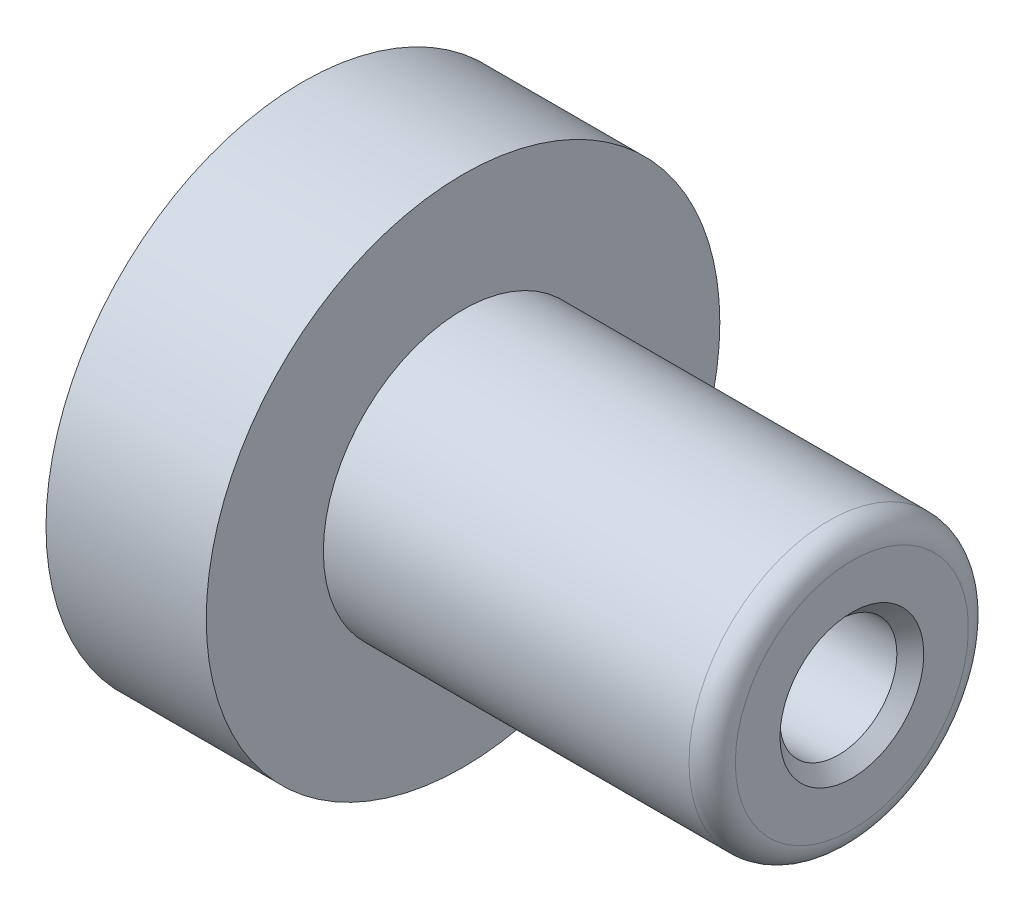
ISO-10303-21;
HEADER;
FILE_DESCRIPTION(('STEP AP214'),'2;1');
FILE_NAME('part.step','',(''),(''),'','','');
FILE_SCHEMA(('AUTOMOTIVE_DESIGN { 1 0 10303 214 1 1 1 1 }'));
ENDSEC;
DATA;
#1=APPLICATION_CONTEXT('core data for automotive mechanical design processes');
#2=APPLICATION_PROTOCOL_DEFINITION('international standard','automotive_design',2000,#1);
#3=PRODUCT_CONTEXT('',#1,'mechanical');
#4=PRODUCT('Part','Part','',(#3));
#5=PRODUCT_RELATED_PRODUCT_CATEGORY('part','',(#4));
#6=PRODUCT_DEFINITION_FORMATION('','',#4);
#7=PRODUCT_DEFINITION_CONTEXT('part definition',#1,'design');
#8=PRODUCT_DEFINITION('design','',#6,#7);
#9=PRODUCT_DEFINITION_SHAPE('','',#8);
#10=(LENGTH_UNIT() NAMED_UNIT(*) SI_UNIT(.MILLI.,.METRE.));
#11=(NAMED_UNIT(*) PLANE_ANGLE_UNIT() SI_UNIT($,.RADIAN.));
#12=(NAMED_UNIT(*) SI_UNIT($,.STERADIAN.) SOLID_ANGLE_UNIT());
#13=UNCERTAINTY_MEASURE_WITH_UNIT(LENGTH_MEASURE(1.E-05),#10,'distance_accuracy_value','');
#14=(GEOMETRIC_REPRESENTATION_CONTEXT(3) GLOBAL_UNCERTAINTY_ASSIGNED_CONTEXT((#13)) GLOBAL_UNIT_ASSIGNED_CONTEXT((#10,
#11,#12)) REPRESENTATION_CONTEXT('',''));
#15=CARTESIAN_POINT('',(0.,0.,0.));
#16=DIRECTION('',(0.,0.,1.));
#17=DIRECTION('',(1.,0.,0.));
#18=AXIS2_PLACEMENT_3D('',#15,#16,#17);
#19=CARTESIAN_POINT('',(0.,0.,0.));
#20=DIRECTION('',(-1.,0.,0.));
#21=DIRECTION('',(0.,0.,1.));
#22=AXIS2_PLACEMENT_3D('',#19,#20,#21);
#23=CYLINDRICAL_SURFACE('',#22,6.7437);
#24=CARTESIAN_POINT('',(20.447,0.,0.));
#25=DIRECTION('',(-1.,0.,0.));
#26=DIRECTION('',(0.,0.,1.));
#27=AXIS2_PLACEMENT_3D('',#24,#25,#26);
#28=CIRCLE('',#27,6.7437);
#29=CARTESIAN_POINT('',(20.447,0.,6.7437));
#30=VERTEX_POINT('',#29);
#31=EDGE_CURVE('E42',#30,#30,#28,.T.);
#32=ORIENTED_EDGE('',*,*,#31,.F.);
#33=EDGE_LOOP('',(#32));
#34=FACE_BOUND('',#33,.T.);
#35=CARTESIAN_POINT('',(0.,0.,0.));
#36=DIRECTION('',(-1.,0.,0.));
#37=DIRECTION('',(0.,0.,1.));
#38=AXIS2_PLACEMENT_3D('',#35,#36,#37);
#39=CIRCLE('',#38,6.7437);
#40=CARTESIAN_POINT('',(0.,0.,6.7437));
#41=VERTEX_POINT('',#40);
#42=EDGE_CURVE('E63',#41,#41,#39,.T.);
#43=ORIENTED_EDGE('',*,*,#42,.T.);
#44=EDGE_LOOP('',(#43));
#45=FACE_BOUND('',#44,.T.);
#46=ADVANCED_FACE('F31',(#34,#45),#23,.F.);
#47=CARTESIAN_POINT('',(20.447,6.7437,0.));
#48=DIRECTION('',(1.,0.,0.));
#49=DIRECTION('',(0.,0.,-1.));
#50=AXIS2_PLACEMENT_3D('',#47,#48,#49);
#51=PLANE('',#50);
#52=CARTESIAN_POINT('',(20.447,0.,0.));
#53=DIRECTION('',(1.,0.,0.));
#54=DIRECTION('',(0.,0.,-1.));
#55=AXIS2_PLACEMENT_3D('',#52,#53,#54);
#56=CIRCLE('',#55,3.9751);
#57=CARTESIAN_POINT('',(20.447,0.,-3.9751));
#58=VERTEX_POINT('',#57);
#59=EDGE_CURVE('E76',#58,#58,#56,.T.);
#60=ORIENTED_EDGE('',*,*,#59,.T.);
#61=EDGE_LOOP('',(#60));
#62=FACE_BOUND('',#61,.T.);
#63=ORIENTED_EDGE('',*,*,#31,.T.);
#64=EDGE_LOOP('',(#63));
#65=FACE_BOUND('',#64,.T.);
#66=ADVANCED_FACE('F82',(#62,#65),#51,.F.);
#67=CARTESIAN_POINT('',(37.338,7.9248,0.));
#68=DIRECTION('',(-1.,0.,0.));
#69=DIRECTION('',(0.,0.,1.));
#70=AXIS2_PLACEMENT_3D('',#67,#68,#69);
#71=PLANE('',#70);
#72=CARTESIAN_POINT('',(37.338,0.,0.));
#73=DIRECTION('',(-1.,0.,0.));
#74=DIRECTION('',(0.,0.,1.));
#75=AXIS2_PLACEMENT_3D('',#72,#73,#74);
#76=CIRCLE('',#75,4.88949999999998);
#77=CARTESIAN_POINT('',(37.338,0.,4.88949999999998));
#78=VERTEX_POINT('',#77);
#79=EDGE_CURVE('E10',#78,#78,#76,.T.);
#80=ORIENTED_EDGE('',*,*,#79,.T.);
#81=EDGE_LOOP('',(#80));
#82=FACE_BOUND('',#81,.T.);
#83=CARTESIAN_POINT('',(37.338,0.,0.));
#84=DIRECTION('',(-1.,0.,0.));
#85=DIRECTION('',(0.,0.,1.));
#86=AXIS2_PLACEMENT_3D('',#83,#84,#85);
#87=CIRCLE('',#86,7.9248);
#88=CARTESIAN_POINT('',(37.338,0.,7.9248));
#89=VERTEX_POINT('',#88);
#90=EDGE_CURVE('E46',#89,#89,#87,.T.);
#91=ORIENTED_EDGE('',*,*,#90,.F.);
#92=EDGE_LOOP('',(#91));
#93=FACE_BOUND('',#92,.T.);
#94=ADVANCED_FACE('F102',(#82,#93),#71,.F.);
#95=CARTESIAN_POINT('',(35.7632,0.,0.));
#96=DIRECTION('',(-1.,0.,0.));
#97=DIRECTION('',(0.,0.,1.));
#98=AXIS2_PLACEMENT_3D('',#95,#96,#97);
#99=TOROIDAL_SURFACE('',#98,7.9248,1.5748);
#100=CARTESIAN_POINT('',(35.7632,0.,0.));
#101=DIRECTION('',(-1.,0.,0.));
#102=DIRECTION('',(0.,0.,1.));
#103=AXIS2_PLACEMENT_3D('',#100,#101,#102);
#104=CIRCLE('',#103,9.4996);
#105=CARTESIAN_POINT('',(35.7632,0.,9.4996));
#106=VERTEX_POINT('',#105);
#107=EDGE_CURVE('E51',#106,#106,#104,.T.);
#108=ORIENTED_EDGE('',*,*,#107,.F.);
#109=EDGE_LOOP('',(#108));
#110=FACE_BOUND('',#109,.T.);
#111=ORIENTED_EDGE('',*,*,#90,.T.);
#112=EDGE_LOOP('',(#111));
#113=FACE_BOUND('',#112,.T.);
#114=ADVANCED_FACE('F109',(#110,#113),#99,.T.);
#115=CARTESIAN_POINT('',(0.,0.,0.));
#116=DIRECTION('',(-1.,0.,0.));
#117=DIRECTION('',(0.,0.,1.));
#118=AXIS2_PLACEMENT_3D('',#115,#116,#117);
#119=CYLINDRICAL_SURFACE('',#118,9.4996);
#120=CARTESIAN_POINT('',(10.8966,0.,0.));
#121=DIRECTION('',(-1.,0.,0.));
#122=DIRECTION('',(0.,0.,1.));
#123=AXIS2_PLACEMENT_3D('',#120,#121,#122);
#124=CIRCLE('',#123,9.4996);
#125=CARTESIAN_POINT('',(10.8966,0.,9.4996));
#126=VERTEX_POINT('',#125);
#127=EDGE_CURVE('E54',#126,#126,#124,.T.);
#128=ORIENTED_EDGE('',*,*,#127,.F.);
#129=EDGE_LOOP('',(#128));
#130=FACE_BOUND('',#129,.T.);
#131=ORIENTED_EDGE('',*,*,#107,.T.);
#132=EDGE_LOOP('',(#131));
#133=FACE_BOUND('',#132,.T.);
#134=ADVANCED_FACE('F112',(#130,#133),#119,.T.);
#135=CARTESIAN_POINT('',(10.8966,17.4625,0.));
#136=DIRECTION('',(-1.,0.,0.));
#137=DIRECTION('',(0.,0.,1.));
#138=AXIS2_PLACEMENT_3D('',#135,#136,#137);
#139=PLANE('',#138);
#140=CARTESIAN_POINT('',(10.8966,0.,0.));
#141=DIRECTION('',(-1.,0.,0.));
#142=DIRECTION('',(0.,0.,1.));
#143=AXIS2_PLACEMENT_3D('',#140,#141,#142);
#144=CIRCLE('',#143,17.4625);
#145=CARTESIAN_POINT('',(10.8966,0.,17.4625));
#146=VERTEX_POINT('',#145);
#147=EDGE_CURVE('E57',#146,#146,#144,.T.);
#148=ORIENTED_EDGE('',*,*,#147,.F.);
#149=EDGE_LOOP('',(#148));
#150=FACE_BOUND('',#149,.T.);
#151=ORIENTED_EDGE('',*,*,#127,.T.);
#152=EDGE_LOOP('',(#151));
#153=FACE_BOUND('',#152,.T.);
#154=ADVANCED_FACE('F116',(#150,#153),#139,.F.);
#155=CARTESIAN_POINT('',(0.,0.,0.));
#156=DIRECTION('',(-1.,0.,0.));
#157=DIRECTION('',(0.,0.,1.));
#158=AXIS2_PLACEMENT_3D('',#155,#156,#157);
#159=CYLINDRICAL_SURFACE('',#158,17.4625);
#160=CARTESIAN_POINT('',(0.,0.,0.));
#161=DIRECTION('',(-1.,0.,0.));
#162=DIRECTION('',(0.,0.,1.));
#163=AXIS2_PLACEMENT_3D('',#160,#161,#162);
#164=CIRCLE('',#163,17.4625);
#165=CARTESIAN_POINT('',(0.,0.,17.4625));
#166=VERTEX_POINT('',#165);
#167=EDGE_CURVE('E60',#166,#166,#164,.T.);
#168=ORIENTED_EDGE('',*,*,#167,.F.);
#169=EDGE_LOOP('',(#168));
#170=FACE_BOUND('',#169,.T.);
#171=ORIENTED_EDGE('',*,*,#147,.T.);
#172=EDGE_LOOP('',(#171));
#173=FACE_BOUND('',#172,.T.);
#174=ADVANCED_FACE('F120',(#170,#173),#159,.T.);
#175=CARTESIAN_POINT('',(0.,6.7437,0.));
#176=DIRECTION('',(1.,0.,0.));
#177=DIRECTION('',(0.,0.,-1.));
#178=AXIS2_PLACEMENT_3D('',#175,#176,#177);
#179=PLANE('',#178);
#180=CARTESIAN_POINT('',(0.,0.,11.1125));
#181=DIRECTION('',(-1.,0.,0.));
#182=DIRECTION('',(0.,0.,-1.));
#183=AXIS2_PLACEMENT_3D('',#180,#181,#182);
#184=CIRCLE('',#183,1.6129);
#185=CARTESIAN_POINT('',(0.,0.,9.4996));
#186=VERTEX_POINT('',#185);
#187=EDGE_CURVE('E73',#186,#186,#184,.T.);
#188=ORIENTED_EDGE('',*,*,#187,.F.);
#189=EDGE_LOOP('',(#188));
#190=FACE_BOUND('',#189,.T.);
#191=CARTESIAN_POINT('',(0.,0.,-11.1125));
#192=DIRECTION('',(-1.,0.,0.));
#193=DIRECTION('',(0.,0.,1.));
#194=AXIS2_PLACEMENT_3D('',#191,#192,#193);
#195=CIRCLE('',#194,1.6129);
#196=CARTESIAN_POINT('',(0.,0.,-9.4996));
#197=VERTEX_POINT('',#196);
#198=EDGE_CURVE('E67',#197,#197,#195,.T.);
#199=ORIENTED_EDGE('',*,*,#198,.F.);
#200=EDGE_LOOP('',(#199));
#201=FACE_BOUND('',#200,.T.);
#202=ORIENTED_EDGE('',*,*,#42,.F.);
#203=EDGE_LOOP('',(#202));
#204=FACE_BOUND('',#203,.T.);
#205=ORIENTED_EDGE('',*,*,#167,.T.);
#206=EDGE_LOOP('',(#205));
#207=FACE_BOUND('',#206,.T.);
#208=ADVANCED_FACE('F124',(#190,#201,#204,#207),#179,.F.);
#209=CARTESIAN_POINT('',(6.35,0.,-11.1125));
#210=DIRECTION('',(-1.,0.,0.));
#211=DIRECTION('',(0.,0.,1.));
#212=AXIS2_PLACEMENT_3D('',#209,#210,#211);
#213=CYLINDRICAL_SURFACE('',#212,1.6129);
#214=CARTESIAN_POINT('',(6.35,0.,-11.1125));
#215=DIRECTION('',(-1.,0.,0.));
#216=DIRECTION('',(0.,0.,1.));
#217=AXIS2_PLACEMENT_3D('',#214,#215,#216);
#218=CIRCLE('',#217,1.6129);
#219=CARTESIAN_POINT('',(6.35,0.,-9.4996));
#220=VERTEX_POINT('',#219);
#221=EDGE_CURVE('E66',#220,#220,#218,.T.);
#222=ORIENTED_EDGE('',*,*,#221,.F.);
#223=EDGE_LOOP('',(#222));
#224=FACE_BOUND('',#223,.T.);
#225=ORIENTED_EDGE('',*,*,#198,.T.);
#226=EDGE_LOOP('',(#225));
#227=FACE_BOUND('',#226,.T.);
#228=ADVANCED_FACE('F128',(#224,#227),#213,.F.);
#229=CARTESIAN_POINT('',(6.35,0.,-11.1125));
#230=DIRECTION('',(-1.,0.,0.));
#231=DIRECTION('',(0.,0.,1.));
#232=AXIS2_PLACEMENT_3D('',#229,#230,#231);
#233=PLANE('',#232);
#234=ORIENTED_EDGE('',*,*,#221,.T.);
#235=EDGE_LOOP('',(#234));
#236=FACE_BOUND('',#235,.T.);
#237=ADVANCED_FACE('F132',(#236),#233,.T.);
#238=CARTESIAN_POINT('',(6.35,0.,11.1125));
#239=DIRECTION('',(-1.,0.,0.));
#240=DIRECTION('',(0.,0.,1.));
#241=AXIS2_PLACEMENT_3D('',#238,#239,#240);
#242=CYLINDRICAL_SURFACE('',#241,1.6129);
#243=CARTESIAN_POINT('',(6.35,0.,11.1125));
#244=DIRECTION('',(-1.,0.,0.));
#245=DIRECTION('',(0.,0.,-1.));
#246=AXIS2_PLACEMENT_3D('',#243,#244,#245);
#247=CIRCLE('',#246,1.6129);
#248=CARTESIAN_POINT('',(6.35,0.,9.4996));
#249=VERTEX_POINT('',#248);
#250=EDGE_CURVE('E70',#249,#249,#247,.T.);
#251=ORIENTED_EDGE('',*,*,#250,.F.);
#252=EDGE_LOOP('',(#251));
#253=FACE_BOUND('',#252,.T.);
#254=ORIENTED_EDGE('',*,*,#187,.T.);
#255=EDGE_LOOP('',(#254));
#256=FACE_BOUND('',#255,.T.);
#257=ADVANCED_FACE('F94',(#253,#256),#242,.F.);
#258=CARTESIAN_POINT('',(6.35,0.,11.1125));
#259=DIRECTION('',(1.,0.,0.));
#260=DIRECTION('',(0.,0.,-1.));
#261=AXIS2_PLACEMENT_3D('',#258,#259,#260);
#262=PLANE('',#261);
#263=ORIENTED_EDGE('',*,*,#250,.T.);
#264=EDGE_LOOP('',(#263));
#265=FACE_BOUND('',#264,.T.);
#266=ADVANCED_FACE('F87',(#265),#262,.F.);
#267=CARTESIAN_POINT('',(0.,0.,0.));
#268=DIRECTION('',(1.,0.,0.));
#269=DIRECTION('',(0.,0.,-1.));
#270=AXIS2_PLACEMENT_3D('',#267,#268,#269);
#271=CYLINDRICAL_SURFACE('',#270,3.9751);
#272=CARTESIAN_POINT('',(36.4236,0.,0.));
#273=DIRECTION('',(-1.,0.,0.));
#274=DIRECTION('',(0.,0.,1.));
#275=AXIS2_PLACEMENT_3D('',#272,#273,#274);
#276=CIRCLE('',#275,3.9751);
#277=CARTESIAN_POINT('',(36.4236,0.,3.9751));
#278=VERTEX_POINT('',#277);
#279=EDGE_CURVE('E38',#278,#278,#276,.F.);
#280=ORIENTED_EDGE('',*,*,#279,.T.);
#281=EDGE_LOOP('',(#280));
#282=FACE_BOUND('',#281,.T.);
#283=ORIENTED_EDGE('',*,*,#59,.F.);
#284=EDGE_LOOP('',(#283));
#285=FACE_BOUND('',#284,.T.);
#286=ADVANCED_FACE('F85',(#282,#285),#271,.F.);
#287=CARTESIAN_POINT('',(36.4236,0.,0.));
#288=DIRECTION('',(1.,0.,0.));
#289=DIRECTION('',(0.,0.,-1.));
#290=AXIS2_PLACEMENT_3D('',#287,#288,#289);
#291=CONICAL_SURFACE('',#290,3.9751,0.785398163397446);
#292=ORIENTED_EDGE('',*,*,#79,.F.);
#293=EDGE_LOOP('',(#292));
#294=FACE_BOUND('',#293,.T.);
#295=ORIENTED_EDGE('',*,*,#279,.F.);
#296=EDGE_LOOP('',(#295));
#297=FACE_BOUND('',#296,.T.);
#298=ADVANCED_FACE('F33',(#294,#297),#291,.F.);
#299=CLOSED_SHELL('',(#46,#66,#94,#114,#134,#154,#174,#208,#228,#237,#257,#266,#286,#298));
#300=MANIFOLD_SOLID_BREP('B2',#299);
#301=ADVANCED_BREP_SHAPE_REPRESENTATION('',(#18,#300),#14);
#302=SHAPE_DEFINITION_REPRESENTATION(#9,#301);
ENDSEC;
END-ISO-10303-21;
